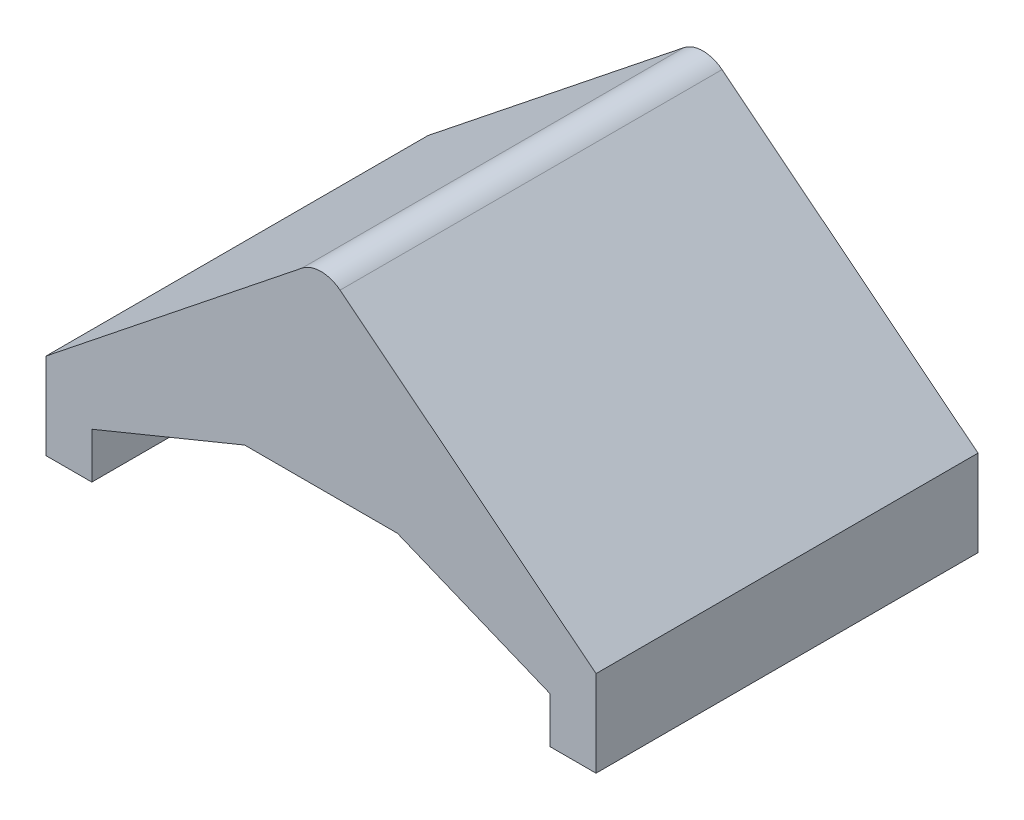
from build123d import *

# Parameters (mm, degrees)
BOSS_EXTRUDE1_DEPTH = 25
FILLET1_R           = 2
SKETCH2_R           = 3.25
CUT_EXTRUDE1_DEPTH  = 8
CHAMFER1_SIZE       = 0.5


with BuildPart() as part:
    # Sketch1 → Boss-Extrude1 (new body)
    with BuildSketch(Plane.XY):
        Polygon((0, 0), (3, 0), (3, 3), (13, 7.1), (23, 7.1), (33, 3), (33, 0), (36, 0), (36, 5.645751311), (18, 20), (0, 5.645751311), align=None)
    extrude(amount=BOSS_EXTRUDE1_DEPTH)

    # Fillet1
    fillet1_edges = [part.edges().sort_by_distance(p)[0] for p in [
        (18, 20, 12.5),
    ]]
    fillet(fillet1_edges, radius=FILLET1_R)

    # Sketch2 → Cut-Extrude1 (cut)
    with BuildSketch(Plane.XZ.offset(-7.1)):
        with Locations(Location((18, 12.5, 0), (0, 0, 270))):
            Circle(SKETCH2_R)
    extrude(amount=-CUT_EXTRUDE1_DEPTH, mode=Mode.SUBTRACT)

    # Chamfer1
    chamfer1_edges = [part.edges().sort_by_distance(p)[0] for p in [
        (18, 7.1, 15.75),
    ]]
    chamfer(chamfer1_edges, length=CHAMFER1_SIZE)


solid = part.part
